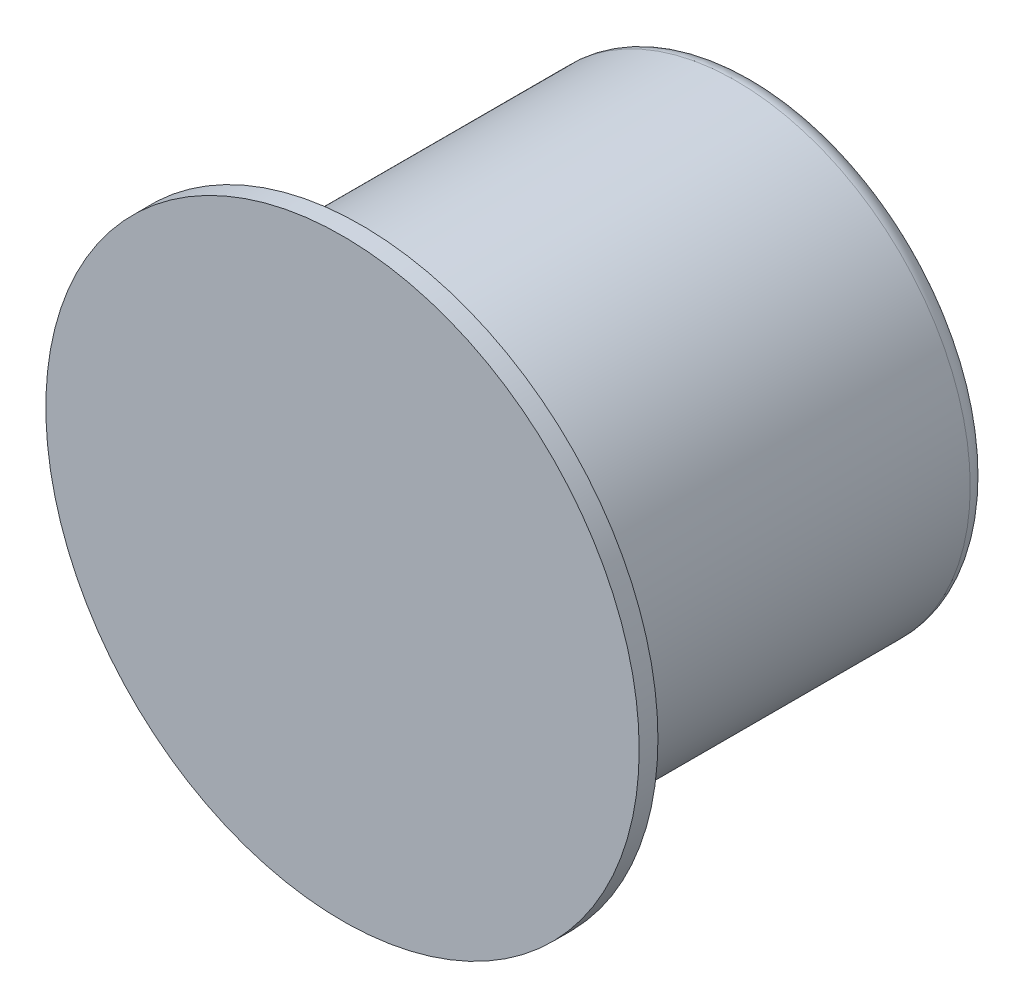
ISO-10303-21;
HEADER;
FILE_DESCRIPTION(('STEP AP214'),'2;1');
FILE_NAME('part.step','',(''),(''),'','','');
FILE_SCHEMA(('AUTOMOTIVE_DESIGN { 1 0 10303 214 1 1 1 1 }'));
ENDSEC;
DATA;
#1=APPLICATION_CONTEXT('core data for automotive mechanical design processes');
#2=APPLICATION_PROTOCOL_DEFINITION('international standard','automotive_design',2000,#1);
#3=PRODUCT_CONTEXT('',#1,'mechanical');
#4=PRODUCT('Part','Part','',(#3));
#5=PRODUCT_RELATED_PRODUCT_CATEGORY('part','',(#4));
#6=PRODUCT_DEFINITION_FORMATION('','',#4);
#7=PRODUCT_DEFINITION_CONTEXT('part definition',#1,'design');
#8=PRODUCT_DEFINITION('design','',#6,#7);
#9=PRODUCT_DEFINITION_SHAPE('','',#8);
#10=(LENGTH_UNIT() NAMED_UNIT(*) SI_UNIT(.MILLI.,.METRE.));
#11=(NAMED_UNIT(*) PLANE_ANGLE_UNIT() SI_UNIT($,.RADIAN.));
#12=(NAMED_UNIT(*) SI_UNIT($,.STERADIAN.) SOLID_ANGLE_UNIT());
#13=UNCERTAINTY_MEASURE_WITH_UNIT(LENGTH_MEASURE(1.E-05),#10,'distance_accuracy_value','');
#14=(GEOMETRIC_REPRESENTATION_CONTEXT(3) GLOBAL_UNCERTAINTY_ASSIGNED_CONTEXT((#13)) GLOBAL_UNIT_ASSIGNED_CONTEXT((#10,
#11,#12)) REPRESENTATION_CONTEXT('',''));
#15=CARTESIAN_POINT('',(0.,0.,0.));
#16=DIRECTION('',(0.,0.,1.));
#17=DIRECTION('',(1.,0.,0.));
#18=AXIS2_PLACEMENT_3D('',#15,#16,#17);
#19=CARTESIAN_POINT('',(0.,0.,0.));
#20=DIRECTION('',(0.,0.,-1.));
#21=DIRECTION('',(-1.,0.,0.));
#22=AXIS2_PLACEMENT_3D('',#19,#20,#21);
#23=PLANE('',#22);
#24=CARTESIAN_POINT('',(0.,0.,0.));
#25=DIRECTION('',(0.,0.,1.));
#26=DIRECTION('',(1.,0.,0.));
#27=AXIS2_PLACEMENT_3D('',#24,#25,#26);
#28=CIRCLE('',#27,47.5);
#29=CARTESIAN_POINT('',(47.5,0.,0.));
#30=VERTEX_POINT('',#29);
#31=EDGE_CURVE('E11',#30,#30,#28,.T.);
#32=ORIENTED_EDGE('',*,*,#31,.T.);
#33=EDGE_LOOP('',(#32));
#34=FACE_BOUND('',#33,.T.);
#35=ADVANCED_FACE('F32',(#34),#23,.F.);
#36=CARTESIAN_POINT('',(0.,0.,0.));
#37=DIRECTION('',(0.,0.,1.));
#38=DIRECTION('',(1.,0.,0.));
#39=AXIS2_PLACEMENT_3D('',#36,#37,#38);
#40=CYLINDRICAL_SURFACE('',#39,47.5);
#41=ORIENTED_EDGE('',*,*,#31,.F.);
#42=EDGE_LOOP('',(#41));
#43=FACE_BOUND('',#42,.T.);
#44=CARTESIAN_POINT('',(0.,0.,-3.));
#45=DIRECTION('',(0.,0.,1.));
#46=DIRECTION('',(1.,0.,0.));
#47=AXIS2_PLACEMENT_3D('',#44,#45,#46);
#48=CIRCLE('',#47,47.5);
#49=CARTESIAN_POINT('',(47.5,0.,-3.));
#50=VERTEX_POINT('',#49);
#51=EDGE_CURVE('E38',#50,#50,#48,.T.);
#52=ORIENTED_EDGE('',*,*,#51,.T.);
#53=EDGE_LOOP('',(#52));
#54=FACE_BOUND('',#53,.T.);
#55=ADVANCED_FACE('F54',(#43,#54),#40,.T.);
#56=CARTESIAN_POINT('',(0.,47.5,-3.));
#57=DIRECTION('',(0.,0.,1.));
#58=DIRECTION('',(1.,0.,0.));
#59=AXIS2_PLACEMENT_3D('',#56,#57,#58);
#60=PLANE('',#59);
#61=ORIENTED_EDGE('',*,*,#51,.F.);
#62=EDGE_LOOP('',(#61));
#63=FACE_BOUND('',#62,.T.);
#64=CARTESIAN_POINT('',(0.,0.,-3.));
#65=DIRECTION('',(0.,0.,1.));
#66=DIRECTION('',(1.,0.,0.));
#67=AXIS2_PLACEMENT_3D('',#64,#65,#66);
#68=CIRCLE('',#67,37.5);
#69=CARTESIAN_POINT('',(37.5,0.,-3.));
#70=VERTEX_POINT('',#69);
#71=EDGE_CURVE('E66',#70,#70,#68,.T.);
#72=ORIENTED_EDGE('',*,*,#71,.T.);
#73=EDGE_LOOP('',(#72));
#74=FACE_BOUND('',#73,.T.);
#75=ADVANCED_FACE('F59',(#63,#74),#60,.F.);
#76=CARTESIAN_POINT('',(0.,0.,0.));
#77=DIRECTION('',(0.,0.,1.));
#78=DIRECTION('',(1.,0.,0.));
#79=AXIS2_PLACEMENT_3D('',#76,#77,#78);
#80=CYLINDRICAL_SURFACE('',#79,37.5);
#81=ORIENTED_EDGE('',*,*,#71,.F.);
#82=EDGE_LOOP('',(#81));
#83=FACE_BOUND('',#82,.T.);
#84=CARTESIAN_POINT('',(0.,0.,-63.));
#85=DIRECTION('',(0.,0.,1.));
#86=DIRECTION('',(1.,0.,0.));
#87=AXIS2_PLACEMENT_3D('',#84,#85,#86);
#88=CIRCLE('',#87,37.5);
#89=CARTESIAN_POINT('',(37.5,0.,-63.));
#90=VERTEX_POINT('',#89);
#91=EDGE_CURVE('E68',#90,#90,#88,.T.);
#92=ORIENTED_EDGE('',*,*,#91,.T.);
#93=EDGE_LOOP('',(#92));
#94=FACE_BOUND('',#93,.T.);
#95=ADVANCED_FACE('F101',(#83,#94),#80,.T.);
#96=CARTESIAN_POINT('',(0.,0.,-63.));
#97=DIRECTION('',(0.,0.,1.));
#98=DIRECTION('',(1.,0.,0.));
#99=AXIS2_PLACEMENT_3D('',#96,#97,#98);
#100=TOROIDAL_SURFACE('',#99,34.5,3.);
#101=ORIENTED_EDGE('',*,*,#91,.F.);
#102=EDGE_LOOP('',(#101));
#103=FACE_BOUND('',#102,.T.);
#104=CARTESIAN_POINT('',(0.,0.,-66.));
#105=DIRECTION('',(0.,0.,1.));
#106=DIRECTION('',(1.,0.,0.));
#107=AXIS2_PLACEMENT_3D('',#104,#105,#106);
#108=CIRCLE('',#107,34.5);
#109=CARTESIAN_POINT('',(34.5,0.,-66.));
#110=VERTEX_POINT('',#109);
#111=EDGE_CURVE('E73',#110,#110,#108,.T.);
#112=ORIENTED_EDGE('',*,*,#111,.T.);
#113=EDGE_LOOP('',(#112));
#114=FACE_BOUND('',#113,.T.);
#115=ADVANCED_FACE('F94',(#103,#114),#100,.T.);
#116=CARTESIAN_POINT('',(0.,34.5,-66.));
#117=DIRECTION('',(0.,0.,1.));
#118=DIRECTION('',(1.,0.,0.));
#119=AXIS2_PLACEMENT_3D('',#116,#117,#118);
#120=PLANE('',#119);
#121=ORIENTED_EDGE('',*,*,#111,.F.);
#122=EDGE_LOOP('',(#121));
#123=FACE_BOUND('',#122,.T.);
#124=CARTESIAN_POINT('',(0.,0.,-66.));
#125=DIRECTION('',(0.,0.,1.));
#126=DIRECTION('',(1.,0.,0.));
#127=AXIS2_PLACEMENT_3D('',#124,#125,#126);
#128=CIRCLE('',#127,5.99999999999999);
#129=CARTESIAN_POINT('',(5.99999999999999,0.,-66.));
#130=VERTEX_POINT('',#129);
#131=EDGE_CURVE('E76',#130,#130,#128,.T.);
#132=ORIENTED_EDGE('',*,*,#131,.T.);
#133=EDGE_LOOP('',(#132));
#134=FACE_BOUND('',#133,.T.);
#135=ADVANCED_FACE('F88',(#123,#134),#120,.F.);
#136=CARTESIAN_POINT('',(0.,0.,-65.));
#137=DIRECTION('',(0.,0.,-1.));
#138=DIRECTION('',(-1.,0.,0.));
#139=AXIS2_PLACEMENT_3D('',#136,#137,#138);
#140=CONICAL_SURFACE('',#139,5.,0.785398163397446);
#141=ORIENTED_EDGE('',*,*,#131,.F.);
#142=EDGE_LOOP('',(#141));
#143=FACE_BOUND('',#142,.T.);
#144=CARTESIAN_POINT('',(0.,0.,-65.));
#145=DIRECTION('',(0.,0.,1.));
#146=DIRECTION('',(1.,0.,0.));
#147=AXIS2_PLACEMENT_3D('',#144,#145,#146);
#148=CIRCLE('',#147,5.);
#149=CARTESIAN_POINT('',(5.,0.,-65.));
#150=VERTEX_POINT('',#149);
#151=EDGE_CURVE('E79',#150,#150,#148,.T.);
#152=ORIENTED_EDGE('',*,*,#151,.T.);
#153=EDGE_LOOP('',(#152));
#154=FACE_BOUND('',#153,.T.);
#155=ADVANCED_FACE('F49',(#143,#154),#140,.F.);
#156=CARTESIAN_POINT('',(0.,0.,0.));
#157=DIRECTION('',(0.,0.,1.));
#158=DIRECTION('',(1.,0.,0.));
#159=AXIS2_PLACEMENT_3D('',#156,#157,#158);
#160=CYLINDRICAL_SURFACE('',#159,5.);
#161=ORIENTED_EDGE('',*,*,#151,.F.);
#162=EDGE_LOOP('',(#161));
#163=FACE_BOUND('',#162,.T.);
#164=CARTESIAN_POINT('',(0.,0.,-54.));
#165=DIRECTION('',(0.,0.,1.));
#166=DIRECTION('',(1.,0.,0.));
#167=AXIS2_PLACEMENT_3D('',#164,#165,#166);
#168=CIRCLE('',#167,5.);
#169=CARTESIAN_POINT('',(5.,0.,-54.));
#170=VERTEX_POINT('',#169);
#171=EDGE_CURVE('E82',#170,#170,#168,.T.);
#172=ORIENTED_EDGE('',*,*,#171,.T.);
#173=EDGE_LOOP('',(#172));
#174=FACE_BOUND('',#173,.T.);
#175=ADVANCED_FACE('F43',(#163,#174),#160,.F.);
#176=CARTESIAN_POINT('',(0.,0.,-51.1132486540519));
#177=DIRECTION('',(0.,0.,-1.));
#178=DIRECTION('',(-1.,0.,0.));
#179=AXIS2_PLACEMENT_3D('',#176,#177,#178);
#180=CONICAL_SURFACE('',#179,0.,1.04719755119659);
#181=ORIENTED_EDGE('',*,*,#171,.F.);
#182=EDGE_LOOP('',(#181));
#183=FACE_BOUND('',#182,.T.);
#184=CARTESIAN_POINT('',(0.,0.,-51.1132486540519));
#185=VERTEX_POINT('',#184);
#186=VERTEX_LOOP('',#185);
#187=FACE_BOUND('',#186,.T.);
#188=ADVANCED_FACE('F41',(#183,#187),#180,.F.);
#189=CLOSED_SHELL('',(#35,#55,#75,#95,#115,#135,#155,#175,#188));
#190=MANIFOLD_SOLID_BREP('B2',#189);
#191=ADVANCED_BREP_SHAPE_REPRESENTATION('',(#18,#190),#14);
#192=SHAPE_DEFINITION_REPRESENTATION(#9,#191);
ENDSEC;
END-ISO-10303-21;
